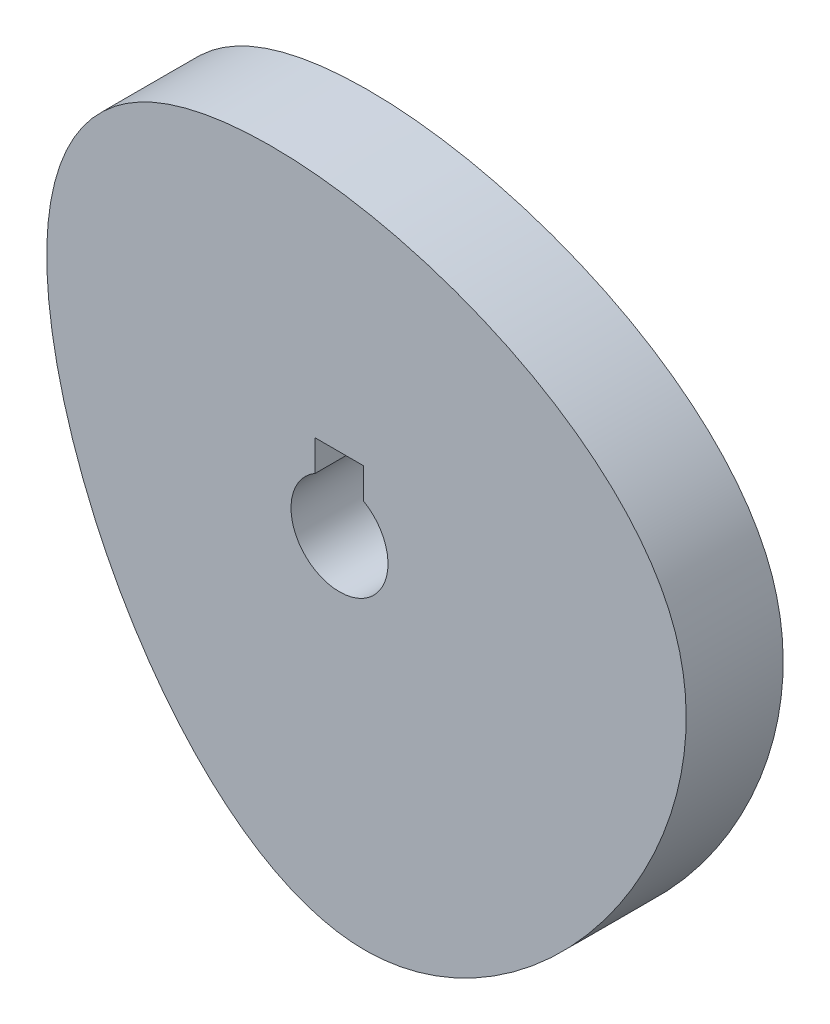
ISO-10303-21;
HEADER;
FILE_DESCRIPTION(('STEP AP214'),'2;1');
FILE_NAME('part.step','',(''),(''),'','','');
FILE_SCHEMA(('AUTOMOTIVE_DESIGN { 1 0 10303 214 1 1 1 1 }'));
ENDSEC;
DATA;
#1=APPLICATION_CONTEXT('core data for automotive mechanical design processes');
#2=APPLICATION_PROTOCOL_DEFINITION('international standard','automotive_design',2000,#1);
#3=PRODUCT_CONTEXT('',#1,'mechanical');
#4=PRODUCT('Part','Part','',(#3));
#5=PRODUCT_RELATED_PRODUCT_CATEGORY('part','',(#4));
#6=PRODUCT_DEFINITION_FORMATION('','',#4);
#7=PRODUCT_DEFINITION_CONTEXT('part definition',#1,'design');
#8=PRODUCT_DEFINITION('design','',#6,#7);
#9=PRODUCT_DEFINITION_SHAPE('','',#8);
#10=(LENGTH_UNIT() NAMED_UNIT(*) SI_UNIT(.MILLI.,.METRE.));
#11=(NAMED_UNIT(*) PLANE_ANGLE_UNIT() SI_UNIT($,.RADIAN.));
#12=(NAMED_UNIT(*) SI_UNIT($,.STERADIAN.) SOLID_ANGLE_UNIT());
#13=UNCERTAINTY_MEASURE_WITH_UNIT(LENGTH_MEASURE(1.E-05),#10,'distance_accuracy_value','');
#14=(GEOMETRIC_REPRESENTATION_CONTEXT(3) GLOBAL_UNCERTAINTY_ASSIGNED_CONTEXT((#13)) GLOBAL_UNIT_ASSIGNED_CONTEXT((#10,
#11,#12)) REPRESENTATION_CONTEXT('',''));
#15=CARTESIAN_POINT('',(0.,0.,0.));
#16=DIRECTION('',(0.,0.,1.));
#17=DIRECTION('',(1.,0.,0.));
#18=AXIS2_PLACEMENT_3D('',#15,#16,#17);
#19=CARTESIAN_POINT('',(-60.3450055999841,21.7099314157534,10.));
#20=CARTESIAN_POINT('',(-61.3494730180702,-15.0603093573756,10.));
#21=CARTESIAN_POINT('',(-1.18585414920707,-125.986286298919,10.));
#22=CARTESIAN_POINT('',(122.485716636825,33.6107395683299,10.));
#23=CARTESIAN_POINT('',(-37.2487615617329,80.1024185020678,10.));
#24=CARTESIAN_POINT('',(-59.8692552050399,39.1255849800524,10.));
#25=CARTESIAN_POINT('',(-60.3450055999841,21.7099314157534,10.));
#26=B_SPLINE_CURVE_WITH_KNOTS('',3,(#19,#20,#21,#22,#23,#24,#25),.UNSPECIFIED.,.T.,.F.,(4,1,1,1,
4),(0.,0.287765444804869,0.58194976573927,0.86370436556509,1.),.UNSPECIFIED.);
#27=DIRECTION('',(0.,0.,-1.));
#28=VECTOR('',#27,1.);
#29=SURFACE_OF_LINEAR_EXTRUSION('',#26,#28);
#30=CARTESIAN_POINT('',(-60.3450055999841,21.7099314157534,10.));
#31=VERTEX_POINT('',#30);
#32=EDGE_CURVE('E11',#31,#31,#26,.T.);
#33=ORIENTED_EDGE('',*,*,#32,.F.);
#34=EDGE_LOOP('',(#33));
#35=FACE_BOUND('',#34,.T.);
#36=CARTESIAN_POINT('',(-60.3450055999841,21.7099314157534,-10.));
#37=CARTESIAN_POINT('',(-61.3494730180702,-15.0603093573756,-10.));
#38=CARTESIAN_POINT('',(-1.18585414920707,-125.986286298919,-10.));
#39=CARTESIAN_POINT('',(122.485716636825,33.6107395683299,-10.));
#40=CARTESIAN_POINT('',(-37.2487615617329,80.1024185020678,-10.));
#41=CARTESIAN_POINT('',(-59.8692552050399,39.1255849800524,-10.));
#42=CARTESIAN_POINT('',(-60.3450055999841,21.7099314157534,-10.));
#43=B_SPLINE_CURVE_WITH_KNOTS('',3,(#36,#37,#38,#39,#40,#41,#42),.UNSPECIFIED.,.T.,.F.,(4,1,1,1,
4),(0.,0.287765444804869,0.58194976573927,0.86370436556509,1.),.UNSPECIFIED.);
#44=CARTESIAN_POINT('',(-60.3450055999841,21.7099314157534,-10.));
#45=VERTEX_POINT('',#44);
#46=EDGE_CURVE('E27',#45,#45,#43,.T.);
#47=ORIENTED_EDGE('',*,*,#46,.T.);
#48=EDGE_LOOP('',(#47));
#49=FACE_BOUND('',#48,.T.);
#50=ADVANCED_FACE('F17',(#35,#49),#29,.F.);
#51=CARTESIAN_POINT('',(68.4579422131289,-15.0570681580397,10.));
#52=DIRECTION('',(0.,0.,1.));
#53=DIRECTION('',(1.,0.,0.));
#54=AXIS2_PLACEMENT_3D('',#51,#52,#53);
#55=PLANE('',#54);
#56=DIRECTION('',(0.,-1.,0.));
#57=VECTOR('',#56,1.);
#58=CARTESIAN_POINT('',(-5.,-154.113103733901,10.));
#59=LINE('',#58,#57);
#60=CARTESIAN_POINT('',(-5.,15.,10.));
#61=VERTEX_POINT('',#60);
#62=CARTESIAN_POINT('',(-5.,8.66025403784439,10.));
#63=VERTEX_POINT('',#62);
#64=EDGE_CURVE('E34',#61,#63,#59,.T.);
#65=ORIENTED_EDGE('',*,*,#64,.F.);
#66=DIRECTION('',(1.,0.,0.));
#67=VECTOR('',#66,1.);
#68=CARTESIAN_POINT('',(7.37402306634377,15.,10.));
#69=LINE('',#68,#67);
#70=CARTESIAN_POINT('',(5.,15.,10.));
#71=VERTEX_POINT('',#70);
#72=EDGE_CURVE('E79',#61,#71,#69,.T.);
#73=ORIENTED_EDGE('',*,*,#72,.T.);
#74=DIRECTION('',(0.,-1.,0.));
#75=VECTOR('',#74,1.);
#76=CARTESIAN_POINT('',(5.,-154.113103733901,10.));
#77=LINE('',#76,#75);
#78=CARTESIAN_POINT('',(5.,8.6602540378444,10.));
#79=VERTEX_POINT('',#78);
#80=EDGE_CURVE('E63',#71,#79,#77,.T.);
#81=ORIENTED_EDGE('',*,*,#80,.T.);
#82=CARTESIAN_POINT('',(0.,0.,10.));
#83=DIRECTION('',(0.,0.,1.));
#84=DIRECTION('',(1.,0.,0.));
#85=AXIS2_PLACEMENT_3D('',#82,#83,#84);
#86=CIRCLE('',#85,10.);
#87=EDGE_CURVE('E72',#63,#79,#86,.T.);
#88=ORIENTED_EDGE('',*,*,#87,.F.);
#89=EDGE_LOOP('',(#65,#73,#81,#88));
#90=FACE_BOUND('',#89,.T.);
#91=ORIENTED_EDGE('',*,*,#32,.T.);
#92=EDGE_LOOP('',(#91));
#93=FACE_BOUND('',#92,.T.);
#94=ADVANCED_FACE('F76',(#90,#93),#55,.T.);
#95=CARTESIAN_POINT('',(68.4579422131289,-15.0570681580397,-10.));
#96=DIRECTION('',(0.,0.,1.));
#97=DIRECTION('',(1.,0.,0.));
#98=AXIS2_PLACEMENT_3D('',#95,#96,#97);
#99=PLANE('',#98);
#100=DIRECTION('',(1.,0.,0.));
#101=VECTOR('',#100,1.);
#102=CARTESIAN_POINT('',(7.37402306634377,15.,-10.));
#103=LINE('',#102,#101);
#104=CARTESIAN_POINT('',(-5.,15.,-10.));
#105=VERTEX_POINT('',#104);
#106=CARTESIAN_POINT('',(5.,15.,-10.));
#107=VERTEX_POINT('',#106);
#108=EDGE_CURVE('E90',#105,#107,#103,.T.);
#109=ORIENTED_EDGE('',*,*,#108,.F.);
#110=DIRECTION('',(0.,-1.,0.));
#111=VECTOR('',#110,1.);
#112=CARTESIAN_POINT('',(-5.,-154.113103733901,-10.));
#113=LINE('',#112,#111);
#114=CARTESIAN_POINT('',(-5.,8.6602540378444,-10.));
#115=VERTEX_POINT('',#114);
#116=EDGE_CURVE('E81',#105,#115,#113,.T.);
#117=ORIENTED_EDGE('',*,*,#116,.T.);
#118=CARTESIAN_POINT('',(0.,0.,-10.));
#119=DIRECTION('',(0.,0.,1.));
#120=DIRECTION('',(1.,0.,0.));
#121=AXIS2_PLACEMENT_3D('',#118,#119,#120);
#122=CIRCLE('',#121,10.);
#123=CARTESIAN_POINT('',(5.,8.66025403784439,-10.));
#124=VERTEX_POINT('',#123);
#125=EDGE_CURVE('E87',#115,#124,#122,.T.);
#126=ORIENTED_EDGE('',*,*,#125,.T.);
#127=DIRECTION('',(0.,-1.,0.));
#128=VECTOR('',#127,1.);
#129=CARTESIAN_POINT('',(5.,-154.113103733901,-10.));
#130=LINE('',#129,#128);
#131=EDGE_CURVE('E66',#107,#124,#130,.T.);
#132=ORIENTED_EDGE('',*,*,#131,.F.);
#133=EDGE_LOOP('',(#109,#117,#126,#132));
#134=FACE_BOUND('',#133,.T.);
#135=ORIENTED_EDGE('',*,*,#46,.F.);
#136=EDGE_LOOP('',(#135));
#137=FACE_BOUND('',#136,.T.);
#138=ADVANCED_FACE('F104',(#134,#137),#99,.F.);
#139=CARTESIAN_POINT('',(-5.,-154.113103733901,-10.));
#140=DIRECTION('',(-1.,0.,0.));
#141=DIRECTION('',(0.,-1.,0.));
#142=AXIS2_PLACEMENT_3D('',#139,#140,#141);
#143=PLANE('',#142);
#144=ORIENTED_EDGE('',*,*,#64,.T.);
#145=DIRECTION('',(0.,0.,1.));
#146=VECTOR('',#145,1.);
#147=CARTESIAN_POINT('',(-5.,8.6602540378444,-10.));
#148=LINE('',#147,#146);
#149=EDGE_CURVE('E69',#115,#63,#148,.T.);
#150=ORIENTED_EDGE('',*,*,#149,.F.);
#151=ORIENTED_EDGE('',*,*,#116,.F.);
#152=DIRECTION('',(0.,0.,1.));
#153=VECTOR('',#152,1.);
#154=CARTESIAN_POINT('',(-5.,15.,-10.));
#155=LINE('',#154,#153);
#156=EDGE_CURVE('E92',#105,#61,#155,.T.);
#157=ORIENTED_EDGE('',*,*,#156,.T.);
#158=EDGE_LOOP('',(#144,#150,#151,#157));
#159=FACE_BOUND('',#158,.T.);
#160=ADVANCED_FACE('F106',(#159),#143,.F.);
#161=CARTESIAN_POINT('',(7.37402306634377,15.,-10.));
#162=DIRECTION('',(0.,-1.,0.));
#163=DIRECTION('',(0.,0.,-1.));
#164=AXIS2_PLACEMENT_3D('',#161,#162,#163);
#165=PLANE('',#164);
#166=ORIENTED_EDGE('',*,*,#72,.F.);
#167=ORIENTED_EDGE('',*,*,#156,.F.);
#168=ORIENTED_EDGE('',*,*,#108,.T.);
#169=DIRECTION('',(0.,0.,1.));
#170=VECTOR('',#169,1.);
#171=CARTESIAN_POINT('',(5.,15.,-10.));
#172=LINE('',#171,#170);
#173=EDGE_CURVE('E68',#107,#71,#172,.T.);
#174=ORIENTED_EDGE('',*,*,#173,.T.);
#175=EDGE_LOOP('',(#166,#167,#168,#174));
#176=FACE_BOUND('',#175,.T.);
#177=ADVANCED_FACE('F115',(#176),#165,.T.);
#178=CARTESIAN_POINT('',(5.,-154.113103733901,-10.));
#179=DIRECTION('',(-1.,0.,0.));
#180=DIRECTION('',(0.,-1.,0.));
#181=AXIS2_PLACEMENT_3D('',#178,#179,#180);
#182=PLANE('',#181);
#183=ORIENTED_EDGE('',*,*,#80,.F.);
#184=ORIENTED_EDGE('',*,*,#173,.F.);
#185=ORIENTED_EDGE('',*,*,#131,.T.);
#186=DIRECTION('',(0.,0.,1.));
#187=VECTOR('',#186,1.);
#188=CARTESIAN_POINT('',(5.,8.6602540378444,-10.));
#189=LINE('',#188,#187);
#190=EDGE_CURVE('E42',#124,#79,#189,.T.);
#191=ORIENTED_EDGE('',*,*,#190,.T.);
#192=EDGE_LOOP('',(#183,#184,#185,#191));
#193=FACE_BOUND('',#192,.T.);
#194=ADVANCED_FACE('F60',(#193),#182,.T.);
#195=CARTESIAN_POINT('',(0.,0.,-10.));
#196=DIRECTION('',(0.,0.,1.));
#197=DIRECTION('',(1.,0.,0.));
#198=AXIS2_PLACEMENT_3D('',#195,#196,#197);
#199=CYLINDRICAL_SURFACE('',#198,10.);
#200=ORIENTED_EDGE('',*,*,#87,.T.);
#201=ORIENTED_EDGE('',*,*,#190,.F.);
#202=ORIENTED_EDGE('',*,*,#125,.F.);
#203=ORIENTED_EDGE('',*,*,#149,.T.);
#204=EDGE_LOOP('',(#200,#201,#202,#203));
#205=FACE_BOUND('',#204,.T.);
#206=ADVANCED_FACE('F73',(#205),#199,.F.);
#207=CLOSED_SHELL('',(#50,#94,#138,#160,#177,#194,#206));
#208=MANIFOLD_SOLID_BREP('B1',#207);
#209=ADVANCED_BREP_SHAPE_REPRESENTATION('',(#18,#208),#14);
#210=SHAPE_DEFINITION_REPRESENTATION(#9,#209);
ENDSEC;
END-ISO-10303-21;
